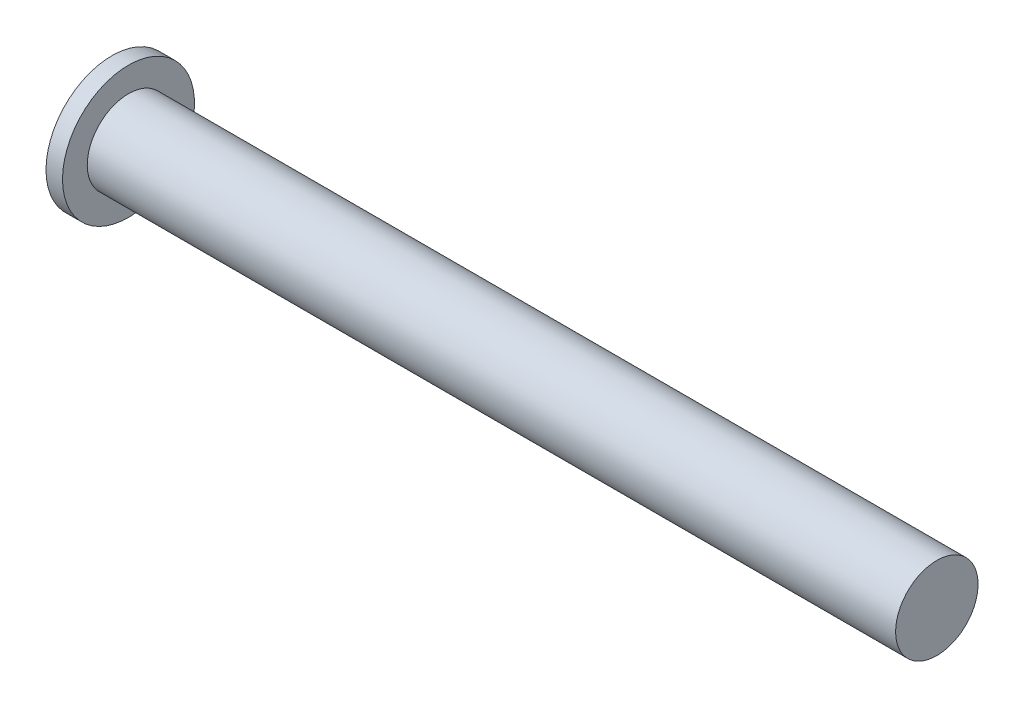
from build123d import *


with BuildPart() as part:
    # Sketch1 → Revolve1 (revolve)
    with BuildSketch(Plane.XY, mode=Mode.PRIVATE) as revolve1_sk:
        Polygon((0, 0), (0, 4.8768), (1.2192, 4.8768), (1.2192, 3.048), (60.96, 3.048), (60.96, 0), align=None)
    revolve(revolve1_sk.sketch.rotate(Axis((60.96, 0, 0), (-1, 0, 0)), 270), axis=Axis((60.96, 0, 0), (-1, 0, 0)))


solid = part.part
